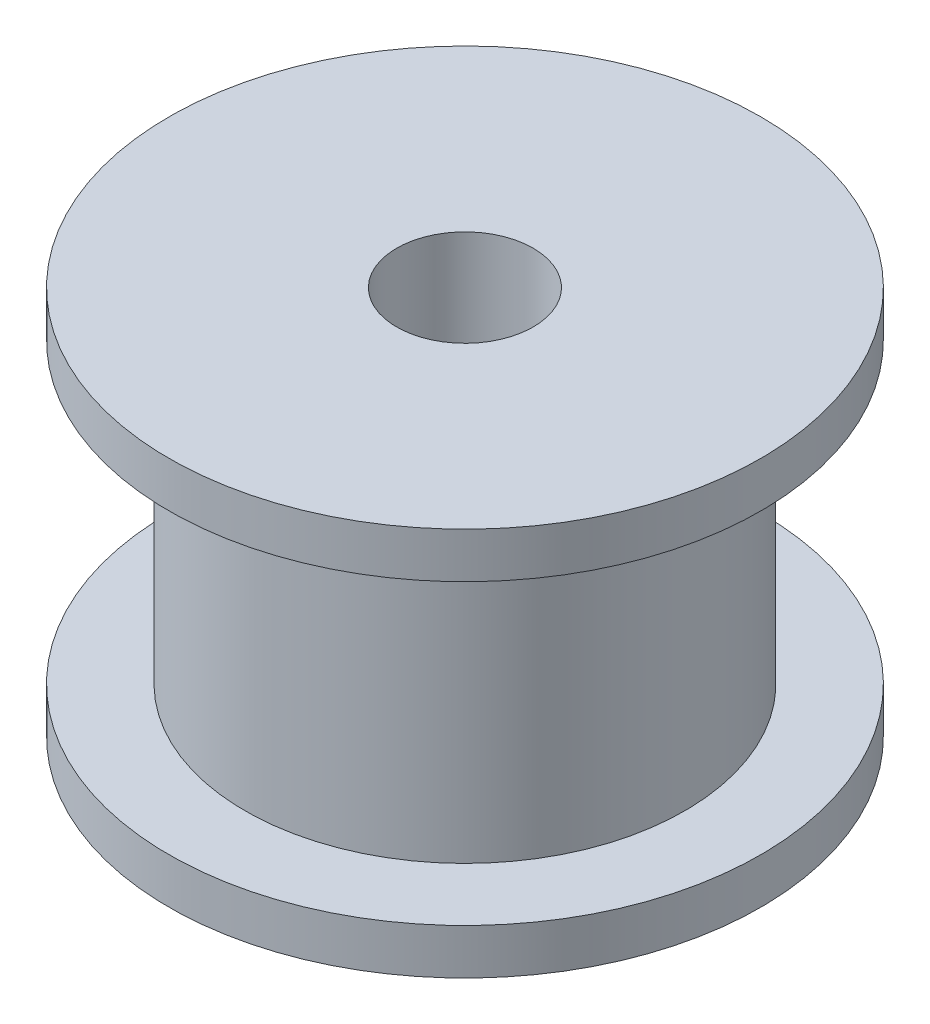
from build123d import *


with BuildPart() as part:
    # Sketch1 → Revolve1 (revolve)
    with BuildSketch(Plane.XY, mode=Mode.PRIVATE) as revolve1_sk:
        Polygon((1.5, 0), (1.5, 8.54), (6.5, 8.54), (6.5, 7.54), (4.83, 7.54), (4.83, 1), (6.5, 1), (6.5, 0), align=None)
    revolve(revolve1_sk.sketch.rotate(Axis((0, 0, 0), (0, 1, 0)), 90), axis=Axis((0, 0, 0), (0, 1, 0)))


solid = part.part
